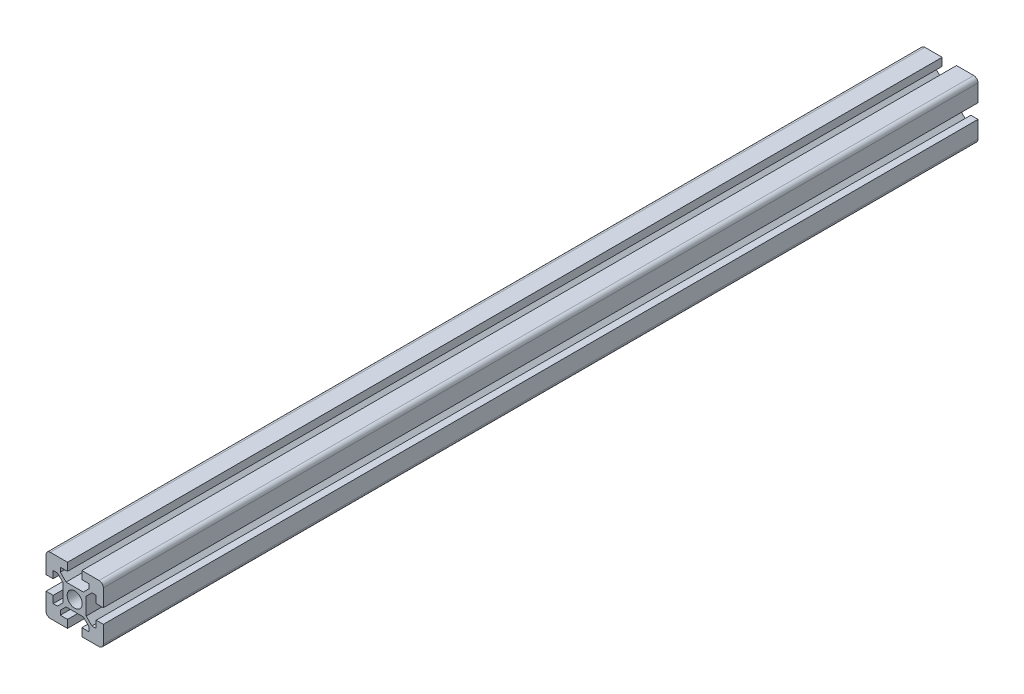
from build123d import *

# Parameters (mm, degrees)
SKETCH_1_R      = 5.25
EXTRUDE_1_DEPTH = 610


with BuildPart() as part:
    # Sketch 1 → Extrude 1 (new body)
    with BuildSketch(Plane.XY):
        with BuildLine():
            Line((10, -5.5), (15, -5.5))
            Line((15, -5.5), (15, 0))
            Line((15, 0), (3, 0))
            ThreePointArc((3, 0), (0.878679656, -0.878679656), (0, -3))
            Line((0, -3), (0, -15))
            Line((0, -15), (5, -15))
            Line((5, -15), (5, -10))
            Line((5, -10), (8, -10))
            Line((8, -10), (12, -14))
            Line((12, -14), (12, -26))
            Line((12, -26), (8, -30))
            Line((8, -30), (5, -30))
            Line((5, -30), (5, -25))
            Line((5, -25), (0, -25))
            Line((0, -25), (0, -37))
            ThreePointArc((0, -37), (0.878679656, -39.121320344), (3, -40))
            Line((3, -40), (15, -40))
            Line((15, -40), (15, -34.5))
            Line((15, -34.5), (10, -34.5))
            Line((10, -34.5), (10, -31.5))
            Line((10, -31.5), (14, -27.5))
            Line((14, -27.5), (26, -27.5))
            Line((26, -27.5), (30, -31.5))
            Line((30, -31.5), (30, -34.5))
            Line((30, -34.5), (25, -34.5))
            Line((25, -34.5), (25, -40))
            Line((25, -40), (37, -40))
            ThreePointArc((37, -40), (39.121320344, -39.121320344), (40, -37))
            Line((40, -37), (40, -25))
            Line((40, -25), (35, -25))
            Line((35, -25), (35, -30))
            Line((35, -30), (32, -30))
            Line((32, -30), (28, -26))
            Line((28, -26), (28, -14))
            Line((28, -14), (32, -10))
            Line((32, -10), (35, -10))
            Line((35, -10), (35, -15))
            Line((35, -15), (40, -15))
            Line((40, -15), (40, -3))
            ThreePointArc((40, -3), (39.121320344, -0.878679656), (37, 0))
            Line((37, 0), (25, 0))
            Line((25, 0), (25, -5.5))
            Line((25, -5.5), (30, -5.5))
            Line((30, -5.5), (30, -8.5))
            Line((30, -8.5), (26, -12.5))
            Line((26, -12.5), (14, -12.5))
            Line((14, -12.5), (10, -8.5))
            Line((10, -8.5), (10, -5.5))
        make_face()
        with Locations((20, -20)):
            Circle(SKETCH_1_R, mode=Mode.SUBTRACT)
    extrude(amount=EXTRUDE_1_DEPTH)


solid = part.part
